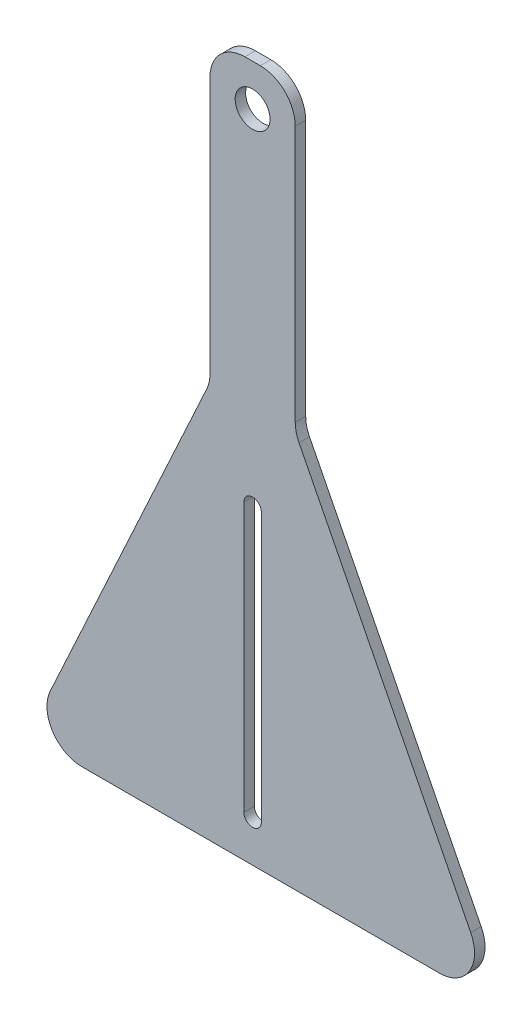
ISO-10303-21;
HEADER;
FILE_DESCRIPTION(('STEP AP214'),'2;1');
FILE_NAME('part.step','',(''),(''),'','','');
FILE_SCHEMA(('AUTOMOTIVE_DESIGN { 1 0 10303 214 1 1 1 1 }'));
ENDSEC;
DATA;
#1=APPLICATION_CONTEXT('core data for automotive mechanical design processes');
#2=APPLICATION_PROTOCOL_DEFINITION('international standard','automotive_design',2000,#1);
#3=PRODUCT_CONTEXT('',#1,'mechanical');
#4=PRODUCT('Part','Part','',(#3));
#5=PRODUCT_RELATED_PRODUCT_CATEGORY('part','',(#4));
#6=PRODUCT_DEFINITION_FORMATION('','',#4);
#7=PRODUCT_DEFINITION_CONTEXT('part definition',#1,'design');
#8=PRODUCT_DEFINITION('design','',#6,#7);
#9=PRODUCT_DEFINITION_SHAPE('','',#8);
#10=(LENGTH_UNIT() NAMED_UNIT(*) SI_UNIT(.MILLI.,.METRE.));
#11=(NAMED_UNIT(*) PLANE_ANGLE_UNIT() SI_UNIT($,.RADIAN.));
#12=(NAMED_UNIT(*) SI_UNIT($,.STERADIAN.) SOLID_ANGLE_UNIT());
#13=UNCERTAINTY_MEASURE_WITH_UNIT(LENGTH_MEASURE(1.E-05),#10,'distance_accuracy_value','');
#14=(GEOMETRIC_REPRESENTATION_CONTEXT(3) GLOBAL_UNCERTAINTY_ASSIGNED_CONTEXT((#13)) GLOBAL_UNIT_ASSIGNED_CONTEXT((#10,
#11,#12)) REPRESENTATION_CONTEXT('',''));
#15=CARTESIAN_POINT('',(0.,0.,0.));
#16=DIRECTION('',(0.,0.,1.));
#17=DIRECTION('',(1.,0.,0.));
#18=AXIS2_PLACEMENT_3D('',#15,#16,#17);
#19=CARTESIAN_POINT('',(53.5516915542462,-177.500472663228,3.));
#20=DIRECTION('',(0.,0.,1.));
#21=DIRECTION('',(1.,0.,0.));
#22=AXIS2_PLACEMENT_3D('',#19,#20,#21);
#23=PLANE('',#22);
#24=DIRECTION('',(0.,-1.,0.));
#25=VECTOR('',#24,1.);
#26=CARTESIAN_POINT('',(-2.5,-98.6712459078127,3.));
#27=LINE('',#26,#25);
#28=CARTESIAN_POINT('',(-2.5,-98.6712459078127,3.));
#29=VERTEX_POINT('',#28);
#30=CARTESIAN_POINT('',(-2.50000000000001,-175.60170502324,3.));
#31=VERTEX_POINT('',#30);
#32=EDGE_CURVE('E173',#29,#31,#27,.T.);
#33=ORIENTED_EDGE('',*,*,#32,.F.);
#34=CARTESIAN_POINT('',(0.,-98.6712459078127,3.));
#35=DIRECTION('',(0.,0.,1.));
#36=DIRECTION('',(-1.,0.,0.));
#37=AXIS2_PLACEMENT_3D('',#34,#35,#36);
#38=CIRCLE('',#37,2.5);
#39=CARTESIAN_POINT('',(2.5,-98.6712459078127,3.));
#40=VERTEX_POINT('',#39);
#41=EDGE_CURVE('E156',#40,#29,#38,.T.);
#42=ORIENTED_EDGE('',*,*,#41,.F.);
#43=DIRECTION('',(0.,1.,0.));
#44=VECTOR('',#43,1.);
#45=CARTESIAN_POINT('',(2.5,-98.6712459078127,3.));
#46=LINE('',#45,#44);
#47=CARTESIAN_POINT('',(2.50000000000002,-175.60170502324,3.));
#48=VERTEX_POINT('',#47);
#49=EDGE_CURVE('E177',#48,#40,#46,.T.);
#50=ORIENTED_EDGE('',*,*,#49,.F.);
#51=CARTESIAN_POINT('',(0.,-175.60170502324,3.));
#52=DIRECTION('',(0.,0.,1.));
#53=DIRECTION('',(1.,0.,0.));
#54=AXIS2_PLACEMENT_3D('',#51,#52,#53);
#55=CIRCLE('',#54,2.50000000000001);
#56=EDGE_CURVE('E175',#31,#48,#55,.T.);
#57=ORIENTED_EDGE('',*,*,#56,.F.);
#58=EDGE_LOOP('',(#33,#42,#50,#57));
#59=FACE_BOUND('',#58,.T.);
#60=CARTESIAN_POINT('',(53.5516915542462,-177.500472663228,3.));
#61=DIRECTION('',(0.,0.,1.));
#62=DIRECTION('',(1.,0.,0.));
#63=AXIS2_PLACEMENT_3D('',#60,#61,#62);
#64=CIRCLE('',#63,10.);
#65=CARTESIAN_POINT('',(53.551691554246,-187.500472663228,3.));
#66=VERTEX_POINT('',#65);
#67=CARTESIAN_POINT('',(62.4690962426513,-172.975001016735,3.));
#68=VERTEX_POINT('',#67);
#69=EDGE_CURVE('E207',#66,#68,#64,.T.);
#70=ORIENTED_EDGE('',*,*,#69,.T.);
#71=DIRECTION('',(-0.452547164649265,0.89174046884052,0.));
#72=VECTOR('',#71,1.);
#73=CARTESIAN_POINT('',(13.2893801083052,-76.0667745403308,3.));
#74=LINE('',#73,#72);
#75=CARTESIAN_POINT('',(13.2893801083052,-76.0667745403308,3.));
#76=VERTEX_POINT('',#75);
#77=EDGE_CURVE('E210',#68,#76,#74,.T.);
#78=ORIENTED_EDGE('',*,*,#77,.T.);
#79=CARTESIAN_POINT('',(22.2067847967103,-71.5413028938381,3.));
#80=DIRECTION('',(0.,0.,-1.));
#81=DIRECTION('',(1.,0.,0.));
#82=AXIS2_PLACEMENT_3D('',#79,#80,#81);
#83=CIRCLE('',#82,10.);
#84=CARTESIAN_POINT('',(12.2067847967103,-71.5413028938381,3.));
#85=VERTEX_POINT('',#84);
#86=EDGE_CURVE('E212',#76,#85,#83,.T.);
#87=ORIENTED_EDGE('',*,*,#86,.T.);
#88=DIRECTION('',(0.,1.,0.));
#89=VECTOR('',#88,1.);
#90=CARTESIAN_POINT('',(12.2067847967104,1.89408419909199,3.));
#91=LINE('',#90,#89);
#92=CARTESIAN_POINT('',(12.2067847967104,1.89408419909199,3.));
#93=VERTEX_POINT('',#92);
#94=EDGE_CURVE('E214',#85,#93,#91,.T.);
#95=ORIENTED_EDGE('',*,*,#94,.T.);
#96=CARTESIAN_POINT('',(2.20678479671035,1.89408419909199,3.));
#97=DIRECTION('',(0.,0.,1.));
#98=DIRECTION('',(1.,0.,0.));
#99=AXIS2_PLACEMENT_3D('',#96,#97,#98);
#100=CIRCLE('',#99,10.);
#101=CARTESIAN_POINT('',(2.20678479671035,11.894084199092,3.));
#102=VERTEX_POINT('',#101);
#103=EDGE_CURVE('E216',#93,#102,#100,.T.);
#104=ORIENTED_EDGE('',*,*,#103,.T.);
#105=DIRECTION('',(-1.,0.,0.));
#106=VECTOR('',#105,1.);
#107=CARTESIAN_POINT('',(-2.20678479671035,11.894084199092,3.));
#108=LINE('',#107,#106);
#109=CARTESIAN_POINT('',(-2.20678479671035,11.894084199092,3.));
#110=VERTEX_POINT('',#109);
#111=EDGE_CURVE('E218',#102,#110,#108,.T.);
#112=ORIENTED_EDGE('',*,*,#111,.T.);
#113=CARTESIAN_POINT('',(-2.20678479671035,1.89408419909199,3.));
#114=DIRECTION('',(0.,0.,1.));
#115=DIRECTION('',(-1.,0.,0.));
#116=AXIS2_PLACEMENT_3D('',#113,#114,#115);
#117=CIRCLE('',#116,10.);
#118=CARTESIAN_POINT('',(-12.2067847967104,1.89408419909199,3.));
#119=VERTEX_POINT('',#118);
#120=EDGE_CURVE('E220',#110,#119,#117,.T.);
#121=ORIENTED_EDGE('',*,*,#120,.T.);
#122=DIRECTION('',(0.,-1.,0.));
#123=VECTOR('',#122,1.);
#124=CARTESIAN_POINT('',(-12.2067847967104,1.89408419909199,3.));
#125=LINE('',#124,#123);
#126=CARTESIAN_POINT('',(-12.2067847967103,-71.7419057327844,3.));
#127=VERTEX_POINT('',#126);
#128=EDGE_CURVE('E222',#119,#127,#125,.T.);
#129=ORIENTED_EDGE('',*,*,#128,.T.);
#130=CARTESIAN_POINT('',(-22.2067847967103,-71.7419057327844,3.));
#131=DIRECTION('',(0.,0.,-1.));
#132=DIRECTION('',(-1.,0.,0.));
#133=AXIS2_PLACEMENT_3D('',#130,#131,#132);
#134=CIRCLE('',#133,10.);
#135=CARTESIAN_POINT('',(-13.1234006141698,-75.9242653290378,3.));
#136=VERTEX_POINT('',#135);
#137=EDGE_CURVE('E224',#127,#136,#134,.T.);
#138=ORIENTED_EDGE('',*,*,#137,.T.);
#139=DIRECTION('',(-0.418235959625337,-0.908338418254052,0.));
#140=VECTOR('',#139,1.);
#141=CARTESIAN_POINT('',(-57.9674901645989,-173.318113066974,3.));
#142=LINE('',#141,#140);
#143=CARTESIAN_POINT('',(-57.9674901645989,-173.318113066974,3.));
#144=VERTEX_POINT('',#143);
#145=EDGE_CURVE('E226',#136,#144,#142,.T.);
#146=ORIENTED_EDGE('',*,*,#145,.T.);
#147=CARTESIAN_POINT('',(-48.8841059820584,-177.500472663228,3.));
#148=DIRECTION('',(0.,0.,1.));
#149=DIRECTION('',(1.,0.,0.));
#150=AXIS2_PLACEMENT_3D('',#147,#148,#149);
#151=CIRCLE('',#150,10.);
#152=CARTESIAN_POINT('',(-48.8841059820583,-187.500472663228,3.));
#153=VERTEX_POINT('',#152);
#154=EDGE_CURVE('E228',#144,#153,#151,.T.);
#155=ORIENTED_EDGE('',*,*,#154,.T.);
#156=DIRECTION('',(1.,0.,0.));
#157=VECTOR('',#156,1.);
#158=CARTESIAN_POINT('',(53.551691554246,-187.500472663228,3.));
#159=LINE('',#158,#157);
#160=EDGE_CURVE('E230',#153,#66,#159,.T.);
#161=ORIENTED_EDGE('',*,*,#160,.T.);
#162=EDGE_LOOP('',(#70,#78,#87,#95,#104,#112,#121,#129,#138,#146,#155,#161));
#163=FACE_BOUND('',#162,.T.);
#164=CARTESIAN_POINT('',(0.,0.,3.));
#165=DIRECTION('',(0.,0.,1.));
#166=DIRECTION('',(1.,0.,0.));
#167=AXIS2_PLACEMENT_3D('',#164,#165,#166);
#168=CIRCLE('',#167,5.);
#169=CARTESIAN_POINT('',(5.,0.,3.));
#170=VERTEX_POINT('',#169);
#171=EDGE_CURVE('E163',#170,#170,#168,.T.);
#172=ORIENTED_EDGE('',*,*,#171,.F.);
#173=EDGE_LOOP('',(#172));
#174=FACE_BOUND('',#173,.T.);
#175=ADVANCED_FACE('F28',(#59,#163,#174),#23,.T.);
#176=CARTESIAN_POINT('',(53.5516915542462,-177.500472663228,0.));
#177=DIRECTION('',(0.,0.,1.));
#178=DIRECTION('',(1.,0.,0.));
#179=AXIS2_PLACEMENT_3D('',#176,#177,#178);
#180=PLANE('',#179);
#181=CARTESIAN_POINT('',(0.,-98.6712459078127,0.));
#182=DIRECTION('',(0.,0.,1.));
#183=DIRECTION('',(-1.,0.,0.));
#184=AXIS2_PLACEMENT_3D('',#181,#182,#183);
#185=CIRCLE('',#184,2.5);
#186=CARTESIAN_POINT('',(2.50000000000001,-98.6712459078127,0.));
#187=VERTEX_POINT('',#186);
#188=CARTESIAN_POINT('',(-2.5,-98.6712459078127,0.));
#189=VERTEX_POINT('',#188);
#190=EDGE_CURVE('E51',#187,#189,#185,.T.);
#191=ORIENTED_EDGE('',*,*,#190,.T.);
#192=DIRECTION('',(0.,-1.,0.));
#193=VECTOR('',#192,1.);
#194=CARTESIAN_POINT('',(-2.5,-98.6712459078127,0.));
#195=LINE('',#194,#193);
#196=CARTESIAN_POINT('',(-2.50000000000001,-175.60170502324,0.));
#197=VERTEX_POINT('',#196);
#198=EDGE_CURVE('E143',#189,#197,#195,.T.);
#199=ORIENTED_EDGE('',*,*,#198,.T.);
#200=CARTESIAN_POINT('',(0.,-175.60170502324,0.));
#201=DIRECTION('',(0.,0.,1.));
#202=DIRECTION('',(1.,0.,0.));
#203=AXIS2_PLACEMENT_3D('',#200,#201,#202);
#204=CIRCLE('',#203,2.50000000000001);
#205=CARTESIAN_POINT('',(2.50000000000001,-175.60170502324,0.));
#206=VERTEX_POINT('',#205);
#207=EDGE_CURVE('E152',#197,#206,#204,.T.);
#208=ORIENTED_EDGE('',*,*,#207,.T.);
#209=DIRECTION('',(0.,1.,0.));
#210=VECTOR('',#209,1.);
#211=CARTESIAN_POINT('',(2.5,-98.6712459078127,0.));
#212=LINE('',#211,#210);
#213=EDGE_CURVE('E162',#206,#187,#212,.T.);
#214=ORIENTED_EDGE('',*,*,#213,.T.);
#215=EDGE_LOOP('',(#191,#199,#208,#214));
#216=FACE_BOUND('',#215,.T.);
#217=CARTESIAN_POINT('',(53.5516915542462,-177.500472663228,0.));
#218=DIRECTION('',(0.,0.,1.));
#219=DIRECTION('',(1.,0.,0.));
#220=AXIS2_PLACEMENT_3D('',#217,#218,#219);
#221=CIRCLE('',#220,10.);
#222=CARTESIAN_POINT('',(53.551691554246,-187.500472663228,0.));
#223=VERTEX_POINT('',#222);
#224=CARTESIAN_POINT('',(62.4690962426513,-172.975001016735,0.));
#225=VERTEX_POINT('',#224);
#226=EDGE_CURVE('E157',#223,#225,#221,.T.);
#227=ORIENTED_EDGE('',*,*,#226,.F.);
#228=DIRECTION('',(1.,0.,0.));
#229=VECTOR('',#228,1.);
#230=CARTESIAN_POINT('',(53.551691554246,-187.500472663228,0.));
#231=LINE('',#230,#229);
#232=CARTESIAN_POINT('',(-48.8841059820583,-187.500472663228,0.));
#233=VERTEX_POINT('',#232);
#234=EDGE_CURVE('E205',#233,#223,#231,.T.);
#235=ORIENTED_EDGE('',*,*,#234,.F.);
#236=CARTESIAN_POINT('',(-48.8841059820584,-177.500472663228,0.));
#237=DIRECTION('',(0.,0.,1.));
#238=DIRECTION('',(1.,0.,0.));
#239=AXIS2_PLACEMENT_3D('',#236,#237,#238);
#240=CIRCLE('',#239,10.);
#241=CARTESIAN_POINT('',(-57.9674901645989,-173.318113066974,0.));
#242=VERTEX_POINT('',#241);
#243=EDGE_CURVE('E203',#242,#233,#240,.T.);
#244=ORIENTED_EDGE('',*,*,#243,.F.);
#245=DIRECTION('',(-0.418235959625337,-0.908338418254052,0.));
#246=VECTOR('',#245,1.);
#247=CARTESIAN_POINT('',(-57.9674901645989,-173.318113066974,0.));
#248=LINE('',#247,#246);
#249=CARTESIAN_POINT('',(-13.1234006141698,-75.9242653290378,0.));
#250=VERTEX_POINT('',#249);
#251=EDGE_CURVE('E201',#250,#242,#248,.T.);
#252=ORIENTED_EDGE('',*,*,#251,.F.);
#253=CARTESIAN_POINT('',(-22.2067847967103,-71.7419057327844,0.));
#254=DIRECTION('',(0.,0.,-1.));
#255=DIRECTION('',(-1.,0.,0.));
#256=AXIS2_PLACEMENT_3D('',#253,#254,#255);
#257=CIRCLE('',#256,10.);
#258=CARTESIAN_POINT('',(-12.2067847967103,-71.7419057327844,0.));
#259=VERTEX_POINT('',#258);
#260=EDGE_CURVE('E199',#259,#250,#257,.T.);
#261=ORIENTED_EDGE('',*,*,#260,.F.);
#262=DIRECTION('',(0.,-1.,0.));
#263=VECTOR('',#262,1.);
#264=CARTESIAN_POINT('',(-12.2067847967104,1.89408419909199,0.));
#265=LINE('',#264,#263);
#266=CARTESIAN_POINT('',(-12.2067847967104,1.89408419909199,0.));
#267=VERTEX_POINT('',#266);
#268=EDGE_CURVE('E197',#267,#259,#265,.T.);
#269=ORIENTED_EDGE('',*,*,#268,.F.);
#270=CARTESIAN_POINT('',(-2.20678479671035,1.89408419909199,0.));
#271=DIRECTION('',(0.,0.,1.));
#272=DIRECTION('',(-1.,0.,0.));
#273=AXIS2_PLACEMENT_3D('',#270,#271,#272);
#274=CIRCLE('',#273,10.);
#275=CARTESIAN_POINT('',(-2.20678479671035,11.894084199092,0.));
#276=VERTEX_POINT('',#275);
#277=EDGE_CURVE('E195',#276,#267,#274,.T.);
#278=ORIENTED_EDGE('',*,*,#277,.F.);
#279=DIRECTION('',(-1.,0.,0.));
#280=VECTOR('',#279,1.);
#281=CARTESIAN_POINT('',(-2.20678479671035,11.894084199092,0.));
#282=LINE('',#281,#280);
#283=CARTESIAN_POINT('',(2.20678479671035,11.894084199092,0.));
#284=VERTEX_POINT('',#283);
#285=EDGE_CURVE('E193',#284,#276,#282,.T.);
#286=ORIENTED_EDGE('',*,*,#285,.F.);
#287=CARTESIAN_POINT('',(2.20678479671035,1.89408419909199,0.));
#288=DIRECTION('',(0.,0.,1.));
#289=DIRECTION('',(1.,0.,0.));
#290=AXIS2_PLACEMENT_3D('',#287,#288,#289);
#291=CIRCLE('',#290,10.);
#292=CARTESIAN_POINT('',(12.2067847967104,1.89408419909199,0.));
#293=VERTEX_POINT('',#292);
#294=EDGE_CURVE('E191',#293,#284,#291,.T.);
#295=ORIENTED_EDGE('',*,*,#294,.F.);
#296=DIRECTION('',(0.,1.,0.));
#297=VECTOR('',#296,1.);
#298=CARTESIAN_POINT('',(12.2067847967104,1.89408419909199,0.));
#299=LINE('',#298,#297);
#300=CARTESIAN_POINT('',(12.2067847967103,-71.5413028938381,0.));
#301=VERTEX_POINT('',#300);
#302=EDGE_CURVE('E189',#301,#293,#299,.T.);
#303=ORIENTED_EDGE('',*,*,#302,.F.);
#304=CARTESIAN_POINT('',(22.2067847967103,-71.5413028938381,0.));
#305=DIRECTION('',(0.,0.,-1.));
#306=DIRECTION('',(1.,0.,0.));
#307=AXIS2_PLACEMENT_3D('',#304,#305,#306);
#308=CIRCLE('',#307,10.);
#309=CARTESIAN_POINT('',(13.2893801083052,-76.0667745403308,0.));
#310=VERTEX_POINT('',#309);
#311=EDGE_CURVE('E187',#310,#301,#308,.T.);
#312=ORIENTED_EDGE('',*,*,#311,.F.);
#313=DIRECTION('',(-0.452547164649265,0.89174046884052,0.));
#314=VECTOR('',#313,1.);
#315=CARTESIAN_POINT('',(13.2893801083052,-76.0667745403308,0.));
#316=LINE('',#315,#314);
#317=EDGE_CURVE('E185',#225,#310,#316,.T.);
#318=ORIENTED_EDGE('',*,*,#317,.F.);
#319=EDGE_LOOP('',(#227,#235,#244,#252,#261,#269,#278,#286,#295,#303,#312,#318));
#320=FACE_BOUND('',#319,.T.);
#321=CARTESIAN_POINT('',(0.,0.,0.));
#322=DIRECTION('',(0.,0.,1.));
#323=DIRECTION('',(1.,0.,0.));
#324=AXIS2_PLACEMENT_3D('',#321,#322,#323);
#325=CIRCLE('',#324,5.);
#326=CARTESIAN_POINT('',(5.,0.,0.));
#327=VERTEX_POINT('',#326);
#328=EDGE_CURVE('E166',#327,#327,#325,.T.);
#329=ORIENTED_EDGE('',*,*,#328,.T.);
#330=EDGE_LOOP('',(#329));
#331=FACE_BOUND('',#330,.T.);
#332=ADVANCED_FACE('F160',(#216,#320,#331),#180,.F.);
#333=CARTESIAN_POINT('',(53.5516915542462,-177.500472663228,3.));
#334=DIRECTION('',(0.,0.,-1.));
#335=DIRECTION('',(-1.,0.,0.));
#336=AXIS2_PLACEMENT_3D('',#333,#334,#335);
#337=CYLINDRICAL_SURFACE('',#336,10.);
#338=ORIENTED_EDGE('',*,*,#226,.T.);
#339=DIRECTION('',(0.,0.,-1.));
#340=VECTOR('',#339,1.);
#341=CARTESIAN_POINT('',(62.4690962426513,-172.975001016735,3.));
#342=LINE('',#341,#340);
#343=EDGE_CURVE('E11',#68,#225,#342,.T.);
#344=ORIENTED_EDGE('',*,*,#343,.F.);
#345=ORIENTED_EDGE('',*,*,#69,.F.);
#346=DIRECTION('',(0.,0.,-1.));
#347=VECTOR('',#346,1.);
#348=CARTESIAN_POINT('',(53.551691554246,-187.500472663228,3.));
#349=LINE('',#348,#347);
#350=EDGE_CURVE('E232',#66,#223,#349,.T.);
#351=ORIENTED_EDGE('',*,*,#350,.T.);
#352=EDGE_LOOP('',(#338,#344,#345,#351));
#353=FACE_BOUND('',#352,.T.);
#354=ADVANCED_FACE('F30',(#353),#337,.T.);
#355=CARTESIAN_POINT('',(13.2893801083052,-76.0667745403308,3.));
#356=DIRECTION('',(-0.89174046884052,-0.452547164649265,0.));
#357=DIRECTION('',(0.452547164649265,-0.89174046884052,0.));
#358=AXIS2_PLACEMENT_3D('',#355,#356,#357);
#359=PLANE('',#358);
#360=ORIENTED_EDGE('',*,*,#317,.T.);
#361=DIRECTION('',(0.,0.,-1.));
#362=VECTOR('',#361,1.);
#363=CARTESIAN_POINT('',(13.2893801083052,-76.0667745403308,3.));
#364=LINE('',#363,#362);
#365=EDGE_CURVE('E36',#76,#310,#364,.T.);
#366=ORIENTED_EDGE('',*,*,#365,.F.);
#367=ORIENTED_EDGE('',*,*,#77,.F.);
#368=ORIENTED_EDGE('',*,*,#343,.T.);
#369=EDGE_LOOP('',(#360,#366,#367,#368));
#370=FACE_BOUND('',#369,.T.);
#371=ADVANCED_FACE('F288',(#370),#359,.F.);
#372=CARTESIAN_POINT('',(22.2067847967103,-71.5413028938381,3.));
#373=DIRECTION('',(0.,0.,-1.));
#374=DIRECTION('',(-1.,0.,0.));
#375=AXIS2_PLACEMENT_3D('',#372,#373,#374);
#376=CYLINDRICAL_SURFACE('',#375,10.);
#377=ORIENTED_EDGE('',*,*,#311,.T.);
#378=DIRECTION('',(0.,0.,-1.));
#379=VECTOR('',#378,1.);
#380=CARTESIAN_POINT('',(12.2067847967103,-71.5413028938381,3.));
#381=LINE('',#380,#379);
#382=EDGE_CURVE('E259',#85,#301,#381,.T.);
#383=ORIENTED_EDGE('',*,*,#382,.F.);
#384=ORIENTED_EDGE('',*,*,#86,.F.);
#385=ORIENTED_EDGE('',*,*,#365,.T.);
#386=EDGE_LOOP('',(#377,#383,#384,#385));
#387=FACE_BOUND('',#386,.T.);
#388=ADVANCED_FACE('F266',(#387),#376,.F.);
#389=CARTESIAN_POINT('',(12.2067847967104,1.89408419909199,3.));
#390=DIRECTION('',(-1.,0.,0.));
#391=DIRECTION('',(0.,-1.,0.));
#392=AXIS2_PLACEMENT_3D('',#389,#390,#391);
#393=PLANE('',#392);
#394=ORIENTED_EDGE('',*,*,#302,.T.);
#395=DIRECTION('',(0.,0.,-1.));
#396=VECTOR('',#395,1.);
#397=CARTESIAN_POINT('',(12.2067847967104,1.89408419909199,3.));
#398=LINE('',#397,#396);
#399=EDGE_CURVE('E256',#93,#293,#398,.T.);
#400=ORIENTED_EDGE('',*,*,#399,.F.);
#401=ORIENTED_EDGE('',*,*,#94,.F.);
#402=ORIENTED_EDGE('',*,*,#382,.T.);
#403=EDGE_LOOP('',(#394,#400,#401,#402));
#404=FACE_BOUND('',#403,.T.);
#405=ADVANCED_FACE('F276',(#404),#393,.F.);
#406=CARTESIAN_POINT('',(2.20678479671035,1.89408419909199,3.));
#407=DIRECTION('',(0.,0.,-1.));
#408=DIRECTION('',(-1.,0.,0.));
#409=AXIS2_PLACEMENT_3D('',#406,#407,#408);
#410=CYLINDRICAL_SURFACE('',#409,10.);
#411=ORIENTED_EDGE('',*,*,#294,.T.);
#412=DIRECTION('',(0.,0.,-1.));
#413=VECTOR('',#412,1.);
#414=CARTESIAN_POINT('',(2.20678479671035,11.894084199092,3.));
#415=LINE('',#414,#413);
#416=EDGE_CURVE('E253',#102,#284,#415,.T.);
#417=ORIENTED_EDGE('',*,*,#416,.F.);
#418=ORIENTED_EDGE('',*,*,#103,.F.);
#419=ORIENTED_EDGE('',*,*,#399,.T.);
#420=EDGE_LOOP('',(#411,#417,#418,#419));
#421=FACE_BOUND('',#420,.T.);
#422=ADVANCED_FACE('F280',(#421),#410,.T.);
#423=CARTESIAN_POINT('',(-2.20678479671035,11.894084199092,3.));
#424=DIRECTION('',(0.,-1.,0.));
#425=DIRECTION('',(0.,0.,-1.));
#426=AXIS2_PLACEMENT_3D('',#423,#424,#425);
#427=PLANE('',#426);
#428=ORIENTED_EDGE('',*,*,#285,.T.);
#429=DIRECTION('',(0.,0.,-1.));
#430=VECTOR('',#429,1.);
#431=CARTESIAN_POINT('',(-2.20678479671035,11.894084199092,3.));
#432=LINE('',#431,#430);
#433=EDGE_CURVE('E250',#110,#276,#432,.T.);
#434=ORIENTED_EDGE('',*,*,#433,.F.);
#435=ORIENTED_EDGE('',*,*,#111,.F.);
#436=ORIENTED_EDGE('',*,*,#416,.T.);
#437=EDGE_LOOP('',(#428,#434,#435,#436));
#438=FACE_BOUND('',#437,.T.);
#439=ADVANCED_FACE('F321',(#438),#427,.F.);
#440=CARTESIAN_POINT('',(-2.20678479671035,1.89408419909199,3.));
#441=DIRECTION('',(0.,0.,-1.));
#442=DIRECTION('',(-1.,0.,0.));
#443=AXIS2_PLACEMENT_3D('',#440,#441,#442);
#444=CYLINDRICAL_SURFACE('',#443,10.);
#445=ORIENTED_EDGE('',*,*,#277,.T.);
#446=DIRECTION('',(0.,0.,-1.));
#447=VECTOR('',#446,1.);
#448=CARTESIAN_POINT('',(-12.2067847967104,1.89408419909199,3.));
#449=LINE('',#448,#447);
#450=EDGE_CURVE('E247',#119,#267,#449,.T.);
#451=ORIENTED_EDGE('',*,*,#450,.F.);
#452=ORIENTED_EDGE('',*,*,#120,.F.);
#453=ORIENTED_EDGE('',*,*,#433,.T.);
#454=EDGE_LOOP('',(#445,#451,#452,#453));
#455=FACE_BOUND('',#454,.T.);
#456=ADVANCED_FACE('F319',(#455),#444,.T.);
#457=CARTESIAN_POINT('',(-12.2067847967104,1.89408419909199,3.));
#458=DIRECTION('',(1.,0.,0.));
#459=DIRECTION('',(0.,1.,0.));
#460=AXIS2_PLACEMENT_3D('',#457,#458,#459);
#461=PLANE('',#460);
#462=ORIENTED_EDGE('',*,*,#268,.T.);
#463=DIRECTION('',(0.,0.,-1.));
#464=VECTOR('',#463,1.);
#465=CARTESIAN_POINT('',(-12.2067847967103,-71.7419057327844,3.));
#466=LINE('',#465,#464);
#467=EDGE_CURVE('E244',#127,#259,#466,.T.);
#468=ORIENTED_EDGE('',*,*,#467,.F.);
#469=ORIENTED_EDGE('',*,*,#128,.F.);
#470=ORIENTED_EDGE('',*,*,#450,.T.);
#471=EDGE_LOOP('',(#462,#468,#469,#470));
#472=FACE_BOUND('',#471,.T.);
#473=ADVANCED_FACE('F315',(#472),#461,.F.);
#474=CARTESIAN_POINT('',(-22.2067847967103,-71.7419057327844,3.));
#475=DIRECTION('',(0.,0.,-1.));
#476=DIRECTION('',(-1.,0.,0.));
#477=AXIS2_PLACEMENT_3D('',#474,#475,#476);
#478=CYLINDRICAL_SURFACE('',#477,10.);
#479=ORIENTED_EDGE('',*,*,#260,.T.);
#480=DIRECTION('',(0.,0.,-1.));
#481=VECTOR('',#480,1.);
#482=CARTESIAN_POINT('',(-13.1234006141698,-75.9242653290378,3.));
#483=LINE('',#482,#481);
#484=EDGE_CURVE('E241',#136,#250,#483,.T.);
#485=ORIENTED_EDGE('',*,*,#484,.F.);
#486=ORIENTED_EDGE('',*,*,#137,.F.);
#487=ORIENTED_EDGE('',*,*,#467,.T.);
#488=EDGE_LOOP('',(#479,#485,#486,#487));
#489=FACE_BOUND('',#488,.T.);
#490=ADVANCED_FACE('F310',(#489),#478,.F.);
#491=CARTESIAN_POINT('',(-57.9674901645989,-173.318113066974,3.));
#492=DIRECTION('',(0.908338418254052,-0.418235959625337,0.));
#493=DIRECTION('',(0.418235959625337,0.908338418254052,0.));
#494=AXIS2_PLACEMENT_3D('',#491,#492,#493);
#495=PLANE('',#494);
#496=ORIENTED_EDGE('',*,*,#251,.T.);
#497=DIRECTION('',(0.,0.,-1.));
#498=VECTOR('',#497,1.);
#499=CARTESIAN_POINT('',(-57.9674901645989,-173.318113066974,3.));
#500=LINE('',#499,#498);
#501=EDGE_CURVE('E238',#144,#242,#500,.T.);
#502=ORIENTED_EDGE('',*,*,#501,.F.);
#503=ORIENTED_EDGE('',*,*,#145,.F.);
#504=ORIENTED_EDGE('',*,*,#484,.T.);
#505=EDGE_LOOP('',(#496,#502,#503,#504));
#506=FACE_BOUND('',#505,.T.);
#507=ADVANCED_FACE('F304',(#506),#495,.F.);
#508=CARTESIAN_POINT('',(-48.8841059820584,-177.500472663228,3.));
#509=DIRECTION('',(0.,0.,-1.));
#510=DIRECTION('',(-1.,0.,0.));
#511=AXIS2_PLACEMENT_3D('',#508,#509,#510);
#512=CYLINDRICAL_SURFACE('',#511,10.);
#513=ORIENTED_EDGE('',*,*,#243,.T.);
#514=DIRECTION('',(0.,0.,-1.));
#515=VECTOR('',#514,1.);
#516=CARTESIAN_POINT('',(-48.8841059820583,-187.500472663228,3.));
#517=LINE('',#516,#515);
#518=EDGE_CURVE('E235',#153,#233,#517,.T.);
#519=ORIENTED_EDGE('',*,*,#518,.F.);
#520=ORIENTED_EDGE('',*,*,#154,.F.);
#521=ORIENTED_EDGE('',*,*,#501,.T.);
#522=EDGE_LOOP('',(#513,#519,#520,#521));
#523=FACE_BOUND('',#522,.T.);
#524=ADVANCED_FACE('F300',(#523),#512,.T.);
#525=CARTESIAN_POINT('',(53.551691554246,-187.500472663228,3.));
#526=DIRECTION('',(0.,1.,0.));
#527=DIRECTION('',(0.,0.,1.));
#528=AXIS2_PLACEMENT_3D('',#525,#526,#527);
#529=PLANE('',#528);
#530=ORIENTED_EDGE('',*,*,#234,.T.);
#531=ORIENTED_EDGE('',*,*,#350,.F.);
#532=ORIENTED_EDGE('',*,*,#160,.F.);
#533=ORIENTED_EDGE('',*,*,#518,.T.);
#534=EDGE_LOOP('',(#530,#531,#532,#533));
#535=FACE_BOUND('',#534,.T.);
#536=ADVANCED_FACE('F295',(#535),#529,.F.);
#537=CARTESIAN_POINT('',(0.,-98.6712459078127,3.));
#538=DIRECTION('',(0.,0.,-1.));
#539=DIRECTION('',(-1.,0.,0.));
#540=AXIS2_PLACEMENT_3D('',#537,#538,#539);
#541=CYLINDRICAL_SURFACE('',#540,2.5);
#542=ORIENTED_EDGE('',*,*,#190,.F.);
#543=DIRECTION('',(0.,0.,-1.));
#544=VECTOR('',#543,1.);
#545=CARTESIAN_POINT('',(2.5,-98.6712459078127,3.));
#546=LINE('',#545,#544);
#547=EDGE_CURVE('E179',#40,#187,#546,.T.);
#548=ORIENTED_EDGE('',*,*,#547,.F.);
#549=ORIENTED_EDGE('',*,*,#41,.T.);
#550=DIRECTION('',(0.,0.,-1.));
#551=VECTOR('',#550,1.);
#552=CARTESIAN_POINT('',(-2.5,-98.6712459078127,3.));
#553=LINE('',#552,#551);
#554=EDGE_CURVE('E145',#29,#189,#553,.T.);
#555=ORIENTED_EDGE('',*,*,#554,.T.);
#556=EDGE_LOOP('',(#542,#548,#549,#555));
#557=FACE_BOUND('',#556,.T.);
#558=ADVANCED_FACE('F154',(#557),#541,.F.);
#559=CARTESIAN_POINT('',(-2.5,-98.6712459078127,3.));
#560=DIRECTION('',(1.,0.,0.));
#561=DIRECTION('',(0.,1.,0.));
#562=AXIS2_PLACEMENT_3D('',#559,#560,#561);
#563=PLANE('',#562);
#564=ORIENTED_EDGE('',*,*,#198,.F.);
#565=ORIENTED_EDGE('',*,*,#554,.F.);
#566=ORIENTED_EDGE('',*,*,#32,.T.);
#567=DIRECTION('',(0.,0.,-1.));
#568=VECTOR('',#567,1.);
#569=CARTESIAN_POINT('',(-2.50000000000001,-175.60170502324,3.));
#570=LINE('',#569,#568);
#571=EDGE_CURVE('E148',#31,#197,#570,.T.);
#572=ORIENTED_EDGE('',*,*,#571,.T.);
#573=EDGE_LOOP('',(#564,#565,#566,#572));
#574=FACE_BOUND('',#573,.T.);
#575=ADVANCED_FACE('F144',(#574),#563,.T.);
#576=CARTESIAN_POINT('',(0.,-175.60170502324,3.));
#577=DIRECTION('',(0.,0.,-1.));
#578=DIRECTION('',(-1.,0.,0.));
#579=AXIS2_PLACEMENT_3D('',#576,#577,#578);
#580=CYLINDRICAL_SURFACE('',#579,2.50000000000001);
#581=ORIENTED_EDGE('',*,*,#207,.F.);
#582=ORIENTED_EDGE('',*,*,#571,.F.);
#583=ORIENTED_EDGE('',*,*,#56,.T.);
#584=DIRECTION('',(0.,0.,-1.));
#585=VECTOR('',#584,1.);
#586=CARTESIAN_POINT('',(2.50000000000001,-175.60170502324,3.));
#587=LINE('',#586,#585);
#588=EDGE_CURVE('E43',#48,#206,#587,.T.);
#589=ORIENTED_EDGE('',*,*,#588,.T.);
#590=EDGE_LOOP('',(#581,#582,#583,#589));
#591=FACE_BOUND('',#590,.T.);
#592=ADVANCED_FACE('F379',(#591),#580,.F.);
#593=CARTESIAN_POINT('',(2.5,-98.6712459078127,3.));
#594=DIRECTION('',(-1.,0.,0.));
#595=DIRECTION('',(0.,-1.,0.));
#596=AXIS2_PLACEMENT_3D('',#593,#594,#595);
#597=PLANE('',#596);
#598=ORIENTED_EDGE('',*,*,#213,.F.);
#599=ORIENTED_EDGE('',*,*,#588,.F.);
#600=ORIENTED_EDGE('',*,*,#49,.T.);
#601=ORIENTED_EDGE('',*,*,#547,.T.);
#602=EDGE_LOOP('',(#598,#599,#600,#601));
#603=FACE_BOUND('',#602,.T.);
#604=ADVANCED_FACE('F386',(#603),#597,.T.);
#605=CARTESIAN_POINT('',(0.,0.,3.));
#606=DIRECTION('',(0.,0.,-1.));
#607=DIRECTION('',(-1.,0.,0.));
#608=AXIS2_PLACEMENT_3D('',#605,#606,#607);
#609=CYLINDRICAL_SURFACE('',#608,5.);
#610=ORIENTED_EDGE('',*,*,#171,.T.);
#611=EDGE_LOOP('',(#610));
#612=FACE_BOUND('',#611,.T.);
#613=ORIENTED_EDGE('',*,*,#328,.F.);
#614=EDGE_LOOP('',(#613));
#615=FACE_BOUND('',#614,.T.);
#616=ADVANCED_FACE('F394',(#612,#615),#609,.F.);
#617=CLOSED_SHELL('',(#175,#332,#354,#371,#388,#405,#422,#439,#456,#473,#490,#507,#524,#536,
#558,#575,#592,#604,#616));
#618=MANIFOLD_SOLID_BREP('B2',#617);
#619=ADVANCED_BREP_SHAPE_REPRESENTATION('',(#18,#618),#14);
#620=SHAPE_DEFINITION_REPRESENTATION(#9,#619);
ENDSEC;
END-ISO-10303-21;
